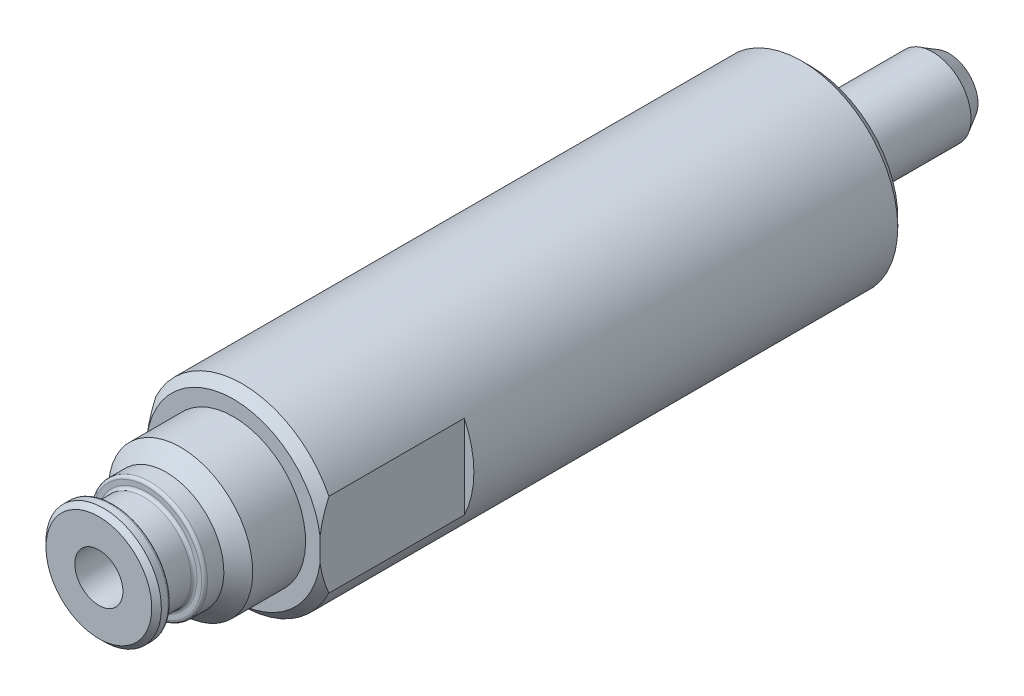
ISO-10303-21;
HEADER;
FILE_DESCRIPTION(('STEP AP214'),'2;1');
FILE_NAME('part.step','',(''),(''),'','','');
FILE_SCHEMA(('AUTOMOTIVE_DESIGN { 1 0 10303 214 1 1 1 1 }'));
ENDSEC;
DATA;
#1=APPLICATION_CONTEXT('core data for automotive mechanical design processes');
#2=APPLICATION_PROTOCOL_DEFINITION('international standard','automotive_design',2000,#1);
#3=PRODUCT_CONTEXT('',#1,'mechanical');
#4=PRODUCT('Part','Part','',(#3));
#5=PRODUCT_RELATED_PRODUCT_CATEGORY('part','',(#4));
#6=PRODUCT_DEFINITION_FORMATION('','',#4);
#7=PRODUCT_DEFINITION_CONTEXT('part definition',#1,'design');
#8=PRODUCT_DEFINITION('design','',#6,#7);
#9=PRODUCT_DEFINITION_SHAPE('','',#8);
#10=(LENGTH_UNIT() NAMED_UNIT(*) SI_UNIT(.MILLI.,.METRE.));
#11=(NAMED_UNIT(*) PLANE_ANGLE_UNIT() SI_UNIT($,.RADIAN.));
#12=(NAMED_UNIT(*) SI_UNIT($,.STERADIAN.) SOLID_ANGLE_UNIT());
#13=UNCERTAINTY_MEASURE_WITH_UNIT(LENGTH_MEASURE(1.E-05),#10,'distance_accuracy_value','');
#14=(GEOMETRIC_REPRESENTATION_CONTEXT(3) GLOBAL_UNCERTAINTY_ASSIGNED_CONTEXT((#13)) GLOBAL_UNIT_ASSIGNED_CONTEXT((#10,
#11,#12)) REPRESENTATION_CONTEXT('',''));
#15=CARTESIAN_POINT('',(0.,0.,0.));
#16=DIRECTION('',(0.,0.,1.));
#17=DIRECTION('',(1.,0.,0.));
#18=AXIS2_PLACEMENT_3D('',#15,#16,#17);
#19=CARTESIAN_POINT('',(0.,0.,-7.));
#20=DIRECTION('',(0.,0.,-1.));
#21=DIRECTION('',(-1.,0.,0.));
#22=AXIS2_PLACEMENT_3D('',#19,#20,#21);
#23=SPHERICAL_SURFACE('',#22,8.);
#24=CARTESIAN_POINT('',(0.,0.,-14.4113534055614));
#25=DIRECTION('',(0.,0.,-1.));
#26=DIRECTION('',(0.,1.,0.));
#27=AXIS2_PLACEMENT_3D('',#24,#25,#26);
#28=CIRCLE('',#27,3.01194965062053);
#29=CARTESIAN_POINT('',(0.,3.01194965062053,-14.4113534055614));
#30=VERTEX_POINT('',#29);
#31=EDGE_CURVE('E9',#30,#30,#28,.T.);
#32=ORIENTED_EDGE('',*,*,#31,.T.);
#33=EDGE_LOOP('',(#32));
#34=FACE_BOUND('',#33,.T.);
#35=ADVANCED_FACE('F14',(#34),#23,.T.);
#36=CARTESIAN_POINT('',(0.,0.,-12.7));
#37=DIRECTION('',(0.,0.,1.));
#38=DIRECTION('',(0.,-1.,0.));
#39=AXIS2_PLACEMENT_3D('',#36,#37,#38);
#40=CONICAL_SURFACE('',#39,4.,0.523598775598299);
#41=ORIENTED_EDGE('',*,*,#31,.F.);
#42=EDGE_LOOP('',(#41));
#43=FACE_BOUND('',#42,.T.);
#44=CARTESIAN_POINT('',(0.,0.,-12.7));
#45=DIRECTION('',(0.,0.,1.));
#46=DIRECTION('',(0.,-1.,0.));
#47=AXIS2_PLACEMENT_3D('',#44,#45,#46);
#48=CIRCLE('',#47,4.);
#49=CARTESIAN_POINT('',(0.,-4.,-12.7));
#50=VERTEX_POINT('',#49);
#51=EDGE_CURVE('E108',#50,#50,#48,.T.);
#52=ORIENTED_EDGE('',*,*,#51,.F.);
#53=EDGE_LOOP('',(#52));
#54=FACE_BOUND('',#53,.T.);
#55=ADVANCED_FACE('F413',(#43,#54),#40,.T.);
#56=CARTESIAN_POINT('',(0.,0.,0.));
#57=DIRECTION('',(0.,0.,-1.));
#58=DIRECTION('',(0.,1.,0.));
#59=AXIS2_PLACEMENT_3D('',#56,#57,#58);
#60=CYLINDRICAL_SURFACE('',#59,4.);
#61=CARTESIAN_POINT('',(0.,0.,0.));
#62=DIRECTION('',(0.,0.,1.));
#63=DIRECTION('',(0.,-1.,0.));
#64=AXIS2_PLACEMENT_3D('',#61,#62,#63);
#65=CIRCLE('',#64,4.);
#66=CARTESIAN_POINT('',(0.,-4.,0.));
#67=VERTEX_POINT('',#66);
#68=EDGE_CURVE('E23',#67,#67,#65,.T.);
#69=ORIENTED_EDGE('',*,*,#68,.F.);
#70=EDGE_LOOP('',(#69));
#71=FACE_BOUND('',#70,.T.);
#72=ORIENTED_EDGE('',*,*,#51,.T.);
#73=EDGE_LOOP('',(#72));
#74=FACE_BOUND('',#73,.T.);
#75=ADVANCED_FACE('F287',(#71,#74),#60,.T.);
#76=CARTESIAN_POINT('',(2.067,0.,74.));
#77=DIRECTION('',(0.,0.,-1.));
#78=DIRECTION('',(0.,1.,0.));
#79=AXIS2_PLACEMENT_3D('',#76,#77,#78);
#80=PLANE('',#79);
#81=CARTESIAN_POINT('',(0.,0.,74.));
#82=DIRECTION('',(0.,0.,1.));
#83=DIRECTION('',(1.,0.,0.));
#84=AXIS2_PLACEMENT_3D('',#81,#82,#83);
#85=CIRCLE('',#84,2.5);
#86=CARTESIAN_POINT('',(2.5,0.,74.));
#87=VERTEX_POINT('',#86);
#88=EDGE_CURVE('E439',#87,#87,#85,.T.);
#89=ORIENTED_EDGE('',*,*,#88,.F.);
#90=EDGE_LOOP('',(#89));
#91=FACE_BOUND('',#90,.T.);
#92=CARTESIAN_POINT('',(0.,0.,74.));
#93=DIRECTION('',(0.,0.,-1.));
#94=DIRECTION('',(0.,1.,0.));
#95=AXIS2_PLACEMENT_3D('',#92,#93,#94);
#96=CIRCLE('',#95,5.5);
#97=CARTESIAN_POINT('',(0.,5.5,74.));
#98=VERTEX_POINT('',#97);
#99=EDGE_CURVE('E153',#98,#98,#96,.T.);
#100=ORIENTED_EDGE('',*,*,#99,.F.);
#101=EDGE_LOOP('',(#100));
#102=FACE_BOUND('',#101,.T.);
#103=ADVANCED_FACE('F275',(#91,#102),#80,.F.);
#104=CARTESIAN_POINT('',(0.,0.,74.));
#105=DIRECTION('',(0.,0.,-1.));
#106=DIRECTION('',(0.,1.,0.));
#107=AXIS2_PLACEMENT_3D('',#104,#105,#106);
#108=CONICAL_SURFACE('',#107,5.5,0.785398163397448);
#109=CARTESIAN_POINT('',(0.,0.,73.5));
#110=DIRECTION('',(0.,0.,-1.));
#111=DIRECTION('',(0.,1.,0.));
#112=AXIS2_PLACEMENT_3D('',#109,#110,#111);
#113=CIRCLE('',#112,6.);
#114=CARTESIAN_POINT('',(0.,6.,73.5));
#115=VERTEX_POINT('',#114);
#116=EDGE_CURVE('E150',#115,#115,#113,.T.);
#117=ORIENTED_EDGE('',*,*,#116,.F.);
#118=EDGE_LOOP('',(#117));
#119=FACE_BOUND('',#118,.T.);
#120=ORIENTED_EDGE('',*,*,#99,.T.);
#121=EDGE_LOOP('',(#120));
#122=FACE_BOUND('',#121,.T.);
#123=ADVANCED_FACE('F305',(#119,#122),#108,.T.);
#124=CARTESIAN_POINT('',(0.,0.,51.5));
#125=DIRECTION('',(0.,0.,-1.));
#126=DIRECTION('',(0.,1.,0.));
#127=AXIS2_PLACEMENT_3D('',#124,#125,#126);
#128=CYLINDRICAL_SURFACE('',#127,6.);
#129=CARTESIAN_POINT('',(0.,0.,72.8));
#130=DIRECTION('',(0.,0.,-1.));
#131=DIRECTION('',(0.,1.,0.));
#132=AXIS2_PLACEMENT_3D('',#129,#130,#131);
#133=CIRCLE('',#132,6.);
#134=CARTESIAN_POINT('',(0.,6.,72.8));
#135=VERTEX_POINT('',#134);
#136=EDGE_CURVE('E147',#135,#135,#133,.T.);
#137=ORIENTED_EDGE('',*,*,#136,.F.);
#138=EDGE_LOOP('',(#137));
#139=FACE_BOUND('',#138,.T.);
#140=ORIENTED_EDGE('',*,*,#116,.T.);
#141=EDGE_LOOP('',(#140));
#142=FACE_BOUND('',#141,.T.);
#143=ADVANCED_FACE('F310',(#139,#142),#128,.T.);
#144=CARTESIAN_POINT('',(0.,0.,72.8));
#145=DIRECTION('',(0.,0.,-1.));
#146=DIRECTION('',(0.,1.,0.));
#147=AXIS2_PLACEMENT_3D('',#144,#145,#146);
#148=TOROIDAL_SURFACE('',#147,5.7,0.300000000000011);
#149=ORIENTED_EDGE('',*,*,#136,.T.);
#150=EDGE_LOOP('',(#149));
#151=FACE_BOUND('',#150,.T.);
#152=CARTESIAN_POINT('',(0.,0.,72.5));
#153=DIRECTION('',(0.,0.,-1.));
#154=DIRECTION('',(0.,1.,0.));
#155=AXIS2_PLACEMENT_3D('',#152,#153,#154);
#156=CIRCLE('',#155,5.7);
#157=CARTESIAN_POINT('',(0.,5.7,72.5));
#158=VERTEX_POINT('',#157);
#159=EDGE_CURVE('E144',#158,#158,#156,.T.);
#160=ORIENTED_EDGE('',*,*,#159,.F.);
#161=EDGE_LOOP('',(#160));
#162=FACE_BOUND('',#161,.T.);
#163=ADVANCED_FACE('F319',(#151,#162),#148,.T.);
#164=CARTESIAN_POINT('',(5.7,0.,72.5));
#165=DIRECTION('',(0.,0.,1.));
#166=DIRECTION('',(0.,-1.,0.));
#167=AXIS2_PLACEMENT_3D('',#164,#165,#166);
#168=PLANE('',#167);
#169=CARTESIAN_POINT('',(0.,0.,72.5));
#170=DIRECTION('',(0.,0.,-1.));
#171=DIRECTION('',(0.,1.,0.));
#172=AXIS2_PLACEMENT_3D('',#169,#170,#171);
#173=CIRCLE('',#172,5.2);
#174=CARTESIAN_POINT('',(0.,5.2,72.5));
#175=VERTEX_POINT('',#174);
#176=EDGE_CURVE('E141',#175,#175,#173,.T.);
#177=ORIENTED_EDGE('',*,*,#176,.F.);
#178=EDGE_LOOP('',(#177));
#179=FACE_BOUND('',#178,.T.);
#180=ORIENTED_EDGE('',*,*,#159,.T.);
#181=EDGE_LOOP('',(#180));
#182=FACE_BOUND('',#181,.T.);
#183=ADVANCED_FACE('F327',(#179,#182),#168,.F.);
#184=CARTESIAN_POINT('',(0.,0.,72.2));
#185=DIRECTION('',(0.,0.,-1.));
#186=DIRECTION('',(0.,1.,0.));
#187=AXIS2_PLACEMENT_3D('',#184,#185,#186);
#188=TOROIDAL_SURFACE('',#187,5.2,0.299999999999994);
#189=CARTESIAN_POINT('',(0.,0.,72.2));
#190=DIRECTION('',(0.,0.,-1.));
#191=DIRECTION('',(0.,1.,0.));
#192=AXIS2_PLACEMENT_3D('',#189,#190,#191);
#193=CIRCLE('',#192,4.9);
#194=CARTESIAN_POINT('',(0.,4.9,72.2));
#195=VERTEX_POINT('',#194);
#196=EDGE_CURVE('E138',#195,#195,#193,.T.);
#197=ORIENTED_EDGE('',*,*,#196,.F.);
#198=EDGE_LOOP('',(#197));
#199=FACE_BOUND('',#198,.T.);
#200=ORIENTED_EDGE('',*,*,#176,.T.);
#201=EDGE_LOOP('',(#200));
#202=FACE_BOUND('',#201,.T.);
#203=ADVANCED_FACE('F335',(#199,#202),#188,.F.);
#204=CARTESIAN_POINT('',(0.,0.,51.5));
#205=DIRECTION('',(0.,0.,-1.));
#206=DIRECTION('',(0.,1.,0.));
#207=AXIS2_PLACEMENT_3D('',#204,#205,#206);
#208=CYLINDRICAL_SURFACE('',#207,4.9);
#209=CARTESIAN_POINT('',(0.,0.,69.3));
#210=DIRECTION('',(0.,0.,-1.));
#211=DIRECTION('',(0.,1.,0.));
#212=AXIS2_PLACEMENT_3D('',#209,#210,#211);
#213=CIRCLE('',#212,4.9);
#214=CARTESIAN_POINT('',(0.,4.9,69.3));
#215=VERTEX_POINT('',#214);
#216=EDGE_CURVE('E135',#215,#215,#213,.T.);
#217=ORIENTED_EDGE('',*,*,#216,.F.);
#218=EDGE_LOOP('',(#217));
#219=FACE_BOUND('',#218,.T.);
#220=ORIENTED_EDGE('',*,*,#196,.T.);
#221=EDGE_LOOP('',(#220));
#222=FACE_BOUND('',#221,.T.);
#223=ADVANCED_FACE('F343',(#219,#222),#208,.T.);
#224=CARTESIAN_POINT('',(0.,0.,69.3));
#225=DIRECTION('',(0.,0.,-1.));
#226=DIRECTION('',(0.,1.,0.));
#227=AXIS2_PLACEMENT_3D('',#224,#225,#226);
#228=TOROIDAL_SURFACE('',#227,5.2,0.29999999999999);
#229=CARTESIAN_POINT('',(0.,0.,69.));
#230=DIRECTION('',(0.,0.,-1.));
#231=DIRECTION('',(0.,1.,0.));
#232=AXIS2_PLACEMENT_3D('',#229,#230,#231);
#233=CIRCLE('',#232,5.2);
#234=CARTESIAN_POINT('',(0.,5.2,69.));
#235=VERTEX_POINT('',#234);
#236=EDGE_CURVE('E132',#235,#235,#233,.T.);
#237=ORIENTED_EDGE('',*,*,#236,.F.);
#238=EDGE_LOOP('',(#237));
#239=FACE_BOUND('',#238,.T.);
#240=ORIENTED_EDGE('',*,*,#216,.T.);
#241=EDGE_LOOP('',(#240));
#242=FACE_BOUND('',#241,.T.);
#243=ADVANCED_FACE('F351',(#239,#242),#228,.F.);
#244=CARTESIAN_POINT('',(5.2,0.,69.));
#245=DIRECTION('',(0.,0.,-1.));
#246=DIRECTION('',(0.,1.,0.));
#247=AXIS2_PLACEMENT_3D('',#244,#245,#246);
#248=PLANE('',#247);
#249=CARTESIAN_POINT('',(0.,0.,69.));
#250=DIRECTION('',(0.,0.,-1.));
#251=DIRECTION('',(0.,1.,0.));
#252=AXIS2_PLACEMENT_3D('',#249,#250,#251);
#253=CIRCLE('',#252,5.7);
#254=CARTESIAN_POINT('',(0.,5.7,69.));
#255=VERTEX_POINT('',#254);
#256=EDGE_CURVE('E129',#255,#255,#253,.T.);
#257=ORIENTED_EDGE('',*,*,#256,.F.);
#258=EDGE_LOOP('',(#257));
#259=FACE_BOUND('',#258,.T.);
#260=ORIENTED_EDGE('',*,*,#236,.T.);
#261=EDGE_LOOP('',(#260));
#262=FACE_BOUND('',#261,.T.);
#263=ADVANCED_FACE('F359',(#259,#262),#248,.F.);
#264=CARTESIAN_POINT('',(0.,0.,68.7));
#265=DIRECTION('',(0.,0.,-1.));
#266=DIRECTION('',(0.,1.,0.));
#267=AXIS2_PLACEMENT_3D('',#264,#265,#266);
#268=TOROIDAL_SURFACE('',#267,5.7,0.300000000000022);
#269=ORIENTED_EDGE('',*,*,#256,.T.);
#270=EDGE_LOOP('',(#269));
#271=FACE_BOUND('',#270,.T.);
#272=CARTESIAN_POINT('',(0.,0.,68.7));
#273=DIRECTION('',(0.,0.,-1.));
#274=DIRECTION('',(0.,1.,0.));
#275=AXIS2_PLACEMENT_3D('',#272,#273,#274);
#276=CIRCLE('',#275,6.);
#277=CARTESIAN_POINT('',(0.,6.,68.7));
#278=VERTEX_POINT('',#277);
#279=EDGE_CURVE('E126',#278,#278,#276,.T.);
#280=ORIENTED_EDGE('',*,*,#279,.F.);
#281=EDGE_LOOP('',(#280));
#282=FACE_BOUND('',#281,.T.);
#283=ADVANCED_FACE('F367',(#271,#282),#268,.T.);
#284=CARTESIAN_POINT('',(0.,0.,51.5));
#285=DIRECTION('',(0.,0.,-1.));
#286=DIRECTION('',(0.,1.,0.));
#287=AXIS2_PLACEMENT_3D('',#284,#285,#286);
#288=CYLINDRICAL_SURFACE('',#287,6.);
#289=CARTESIAN_POINT('',(0.,0.,67.));
#290=DIRECTION('',(0.,0.,-1.));
#291=DIRECTION('',(0.,1.,0.));
#292=AXIS2_PLACEMENT_3D('',#289,#290,#291);
#293=CIRCLE('',#292,6.);
#294=CARTESIAN_POINT('',(0.,6.,67.));
#295=VERTEX_POINT('',#294);
#296=EDGE_CURVE('E122',#295,#295,#293,.T.);
#297=ORIENTED_EDGE('',*,*,#296,.F.);
#298=EDGE_LOOP('',(#297));
#299=FACE_BOUND('',#298,.T.);
#300=ORIENTED_EDGE('',*,*,#279,.T.);
#301=EDGE_LOOP('',(#300));
#302=FACE_BOUND('',#301,.T.);
#303=ADVANCED_FACE('F375',(#299,#302),#288,.T.);
#304=CARTESIAN_POINT('',(0.,0.,67.));
#305=DIRECTION('',(0.,0.,-1.));
#306=DIRECTION('',(0.,1.,0.));
#307=AXIS2_PLACEMENT_3D('',#304,#305,#306);
#308=CONICAL_SURFACE('',#307,6.,0.785398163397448);
#309=CARTESIAN_POINT('',(0.,0.,65.5));
#310=DIRECTION('',(0.,0.,-1.));
#311=DIRECTION('',(0.,1.,0.));
#312=AXIS2_PLACEMENT_3D('',#309,#310,#311);
#313=CIRCLE('',#312,7.5);
#314=CARTESIAN_POINT('',(0.,7.5,65.5));
#315=VERTEX_POINT('',#314);
#316=EDGE_CURVE('E119',#315,#315,#313,.T.);
#317=ORIENTED_EDGE('',*,*,#316,.F.);
#318=EDGE_LOOP('',(#317));
#319=FACE_BOUND('',#318,.T.);
#320=ORIENTED_EDGE('',*,*,#296,.T.);
#321=EDGE_LOOP('',(#320));
#322=FACE_BOUND('',#321,.T.);
#323=ADVANCED_FACE('F191',(#319,#322),#308,.T.);
#324=CARTESIAN_POINT('',(0.,0.,51.5));
#325=DIRECTION('',(0.,0.,-1.));
#326=DIRECTION('',(0.,1.,0.));
#327=AXIS2_PLACEMENT_3D('',#324,#325,#326);
#328=CYLINDRICAL_SURFACE('',#327,7.5);
#329=CARTESIAN_POINT('',(0.,0.,60.));
#330=DIRECTION('',(0.,0.,-1.));
#331=DIRECTION('',(0.,1.,0.));
#332=AXIS2_PLACEMENT_3D('',#329,#330,#331);
#333=CIRCLE('',#332,7.5);
#334=CARTESIAN_POINT('',(0.,7.5,60.));
#335=VERTEX_POINT('',#334);
#336=EDGE_CURVE('E95',#335,#335,#333,.T.);
#337=ORIENTED_EDGE('',*,*,#336,.F.);
#338=EDGE_LOOP('',(#337));
#339=FACE_BOUND('',#338,.T.);
#340=ORIENTED_EDGE('',*,*,#316,.T.);
#341=EDGE_LOOP('',(#340));
#342=FACE_BOUND('',#341,.T.);
#343=ADVANCED_FACE('F181',(#339,#342),#328,.T.);
#344=CARTESIAN_POINT('',(9.08,0.,60.));
#345=DIRECTION('',(0.,0.,1.));
#346=DIRECTION('',(0.,-1.,0.));
#347=AXIS2_PLACEMENT_3D('',#344,#345,#346);
#348=PLANE('',#347);
#349=ORIENTED_EDGE('',*,*,#336,.T.);
#350=EDGE_LOOP('',(#349));
#351=FACE_BOUND('',#350,.T.);
#352=CARTESIAN_POINT('',(0.,0.,60.));
#353=DIRECTION('',(0.,0.,-1.));
#354=DIRECTION('',(0.,1.,0.));
#355=AXIS2_PLACEMENT_3D('',#352,#353,#354);
#356=CIRCLE('',#355,9.08);
#357=CARTESIAN_POINT('',(-9.,1.20266371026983,60.));
#358=VERTEX_POINT('',#357);
#359=CARTESIAN_POINT('',(9.,1.20266371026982,60.));
#360=VERTEX_POINT('',#359);
#361=EDGE_CURVE('E92',#358,#360,#356,.T.);
#362=ORIENTED_EDGE('',*,*,#361,.F.);
#363=DIRECTION('',(0.,-1.,0.));
#364=VECTOR('',#363,1.);
#365=CARTESIAN_POINT('',(-9.,0.,60.));
#366=LINE('',#365,#364);
#367=CARTESIAN_POINT('',(-9.,-1.20266371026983,60.));
#368=VERTEX_POINT('',#367);
#369=EDGE_CURVE('E78',#358,#368,#366,.T.);
#370=ORIENTED_EDGE('',*,*,#369,.T.);
#371=CARTESIAN_POINT('',(9.,-1.20266371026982,60.));
#372=VERTEX_POINT('',#371);
#373=EDGE_CURVE('E85',#372,#368,#356,.T.);
#374=ORIENTED_EDGE('',*,*,#373,.F.);
#375=DIRECTION('',(0.,1.,0.));
#376=VECTOR('',#375,1.);
#377=CARTESIAN_POINT('',(9.,0.,60.));
#378=LINE('',#377,#376);
#379=EDGE_CURVE('E68',#372,#360,#378,.T.);
#380=ORIENTED_EDGE('',*,*,#379,.T.);
#381=EDGE_LOOP('',(#362,#370,#374,#380));
#382=FACE_BOUND('',#381,.T.);
#383=ADVANCED_FACE('F90',(#351,#382),#348,.T.);
#384=CARTESIAN_POINT('',(0.,0.,59.08));
#385=DIRECTION('',(0.,0.,-1.));
#386=DIRECTION('',(0.,1.,0.));
#387=AXIS2_PLACEMENT_3D('',#384,#385,#386);
#388=CONICAL_SURFACE('',#387,10.,0.78539816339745);
#389=CARTESIAN_POINT('',(0.,0.,59.08));
#390=DIRECTION('',(0.,0.,-1.));
#391=DIRECTION('',(0.,1.,0.));
#392=AXIS2_PLACEMENT_3D('',#389,#390,#391);
#393=CIRCLE('',#392,10.);
#394=CARTESIAN_POINT('',(-9.,4.35889894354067,59.08));
#395=VERTEX_POINT('',#394);
#396=CARTESIAN_POINT('',(9.,4.35889894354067,59.08));
#397=VERTEX_POINT('',#396);
#398=EDGE_CURVE('E91',#395,#397,#393,.T.);
#399=ORIENTED_EDGE('',*,*,#398,.F.);
#400=CARTESIAN_POINT('',(-9.,20.0889844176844,47.0671107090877));
#401=CARTESIAN_POINT('',(-9.,19.7941845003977,47.3361376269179));
#402=CARTESIAN_POINT('',(-9.,19.4988987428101,47.6046332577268));
#403=CARTESIAN_POINT('',(-9.,18.9072134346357,48.1403994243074));
#404=CARTESIAN_POINT('',(-9.,18.6108138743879,48.4076699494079));
#405=CARTESIAN_POINT('',(-9.,18.0166892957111,48.9408857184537));
#406=CARTESIAN_POINT('',(-9.,17.7189639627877,49.2068306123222));
#407=CARTESIAN_POINT('',(-9.,17.1220890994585,49.7371142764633));
#408=CARTESIAN_POINT('',(-9.,16.822939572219,50.0014530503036));
#409=CARTESIAN_POINT('',(-9.,15.9186985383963,50.7955547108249));
#410=CARTESIAN_POINT('',(-9.,15.3111326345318,51.3225158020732));
#411=CARTESIAN_POINT('',(-9.,14.3932925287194,52.1052669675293));
#412=CARTESIAN_POINT('',(-9.,14.0862824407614,52.3648870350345));
#413=CARTESIAN_POINT('',(-9.,13.4697157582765,52.8810880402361));
#414=CARTESIAN_POINT('',(-9.,13.1601591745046,53.137668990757));
#415=CARTESIAN_POINT('',(-9.,12.5849192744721,53.6088254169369));
#416=CARTESIAN_POINT('',(-9.,12.3196505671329,53.8239068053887));
#417=CARTESIAN_POINT('',(-9.,11.7866455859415,54.2509886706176));
#418=CARTESIAN_POINT('',(-9.,11.5189093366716,54.4629891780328));
#419=CARTESIAN_POINT('',(-9.,10.9804995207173,54.883413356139));
#420=CARTESIAN_POINT('',(-9.,10.7098250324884,55.0918358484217));
#421=CARTESIAN_POINT('',(-9.,10.1651714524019,55.5043204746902));
#422=CARTESIAN_POINT('',(-9.,9.89119239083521,55.7083826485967));
#423=CARTESIAN_POINT('',(-9.,9.33978293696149,56.1109565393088));
#424=CARTESIAN_POINT('',(-9.,9.06235809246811,56.3094758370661));
#425=CARTESIAN_POINT('',(-9.,8.50301529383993,56.7001296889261));
#426=CARTESIAN_POINT('',(-9.,8.22109712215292,56.8922639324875));
#427=CARTESIAN_POINT('',(-9.,7.65217834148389,57.2685512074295));
#428=CARTESIAN_POINT('',(-9.,7.36518050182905,57.4527084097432));
#429=CARTESIAN_POINT('',(-9.,6.78513344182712,57.8111918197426));
#430=CARTESIAN_POINT('',(-9.,6.49208508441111,57.9855194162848));
#431=CARTESIAN_POINT('',(-9.,5.90679788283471,58.317393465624));
#432=CARTESIAN_POINT('',(-9.,5.61474269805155,58.4752618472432));
#433=CARTESIAN_POINT('',(-9.,5.02305416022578,58.7763015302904));
#434=CARTESIAN_POINT('',(-9.,4.72342010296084,58.9194714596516));
#435=CARTESIAN_POINT('',(-9.,4.11636189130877,59.1870563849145));
#436=CARTESIAN_POINT('',(-9.,3.80895049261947,59.3115000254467));
#437=CARTESIAN_POINT('',(-9.,3.18569208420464,59.5372331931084));
#438=CARTESIAN_POINT('',(-9.,2.86984745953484,59.6385291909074));
#439=CARTESIAN_POINT('',(-9.,2.29142781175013,59.7962123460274));
#440=CARTESIAN_POINT('',(-9.,2.03019136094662,59.8574808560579));
#441=CARTESIAN_POINT('',(-9.,1.5036267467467,59.958913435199));
#442=CARTESIAN_POINT('',(-9.,1.23829917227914,59.9990805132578));
#443=CARTESIAN_POINT('',(-9.,0.705706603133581,60.0562472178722));
#444=CARTESIAN_POINT('',(-9.,0.438447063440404,60.0732969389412));
#445=CARTESIAN_POINT('',(-9.,-0.0965355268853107,60.0834560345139));
#446=CARTESIAN_POINT('',(-9.,-0.364258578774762,60.076565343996));
#447=CARTESIAN_POINT('',(-9.,-0.89754729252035,60.0392623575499));
#448=CARTESIAN_POINT('',(-9.,-1.1631159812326,60.0088926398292));
#449=CARTESIAN_POINT('',(-9.,-1.69079838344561,59.9262664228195));
#450=CARTESIAN_POINT('',(-9.,-1.95291180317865,59.8740080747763));
#451=CARTESIAN_POINT('',(-9.,-2.47314253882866,59.7498122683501));
#452=CARTESIAN_POINT('',(-9.,-2.73124679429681,59.6778207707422));
#453=CARTESIAN_POINT('',(-9.,-3.24205693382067,59.516938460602));
#454=CARTESIAN_POINT('',(-9.,-3.49476303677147,59.4280483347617));
#455=CARTESIAN_POINT('',(-9.,-4.07604409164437,59.2047542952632));
#456=CARTESIAN_POINT('',(-9.,-4.40253716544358,59.0649539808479));
#457=CARTESIAN_POINT('',(-9.,-5.0464515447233,58.7656734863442));
#458=CARTESIAN_POINT('',(-9.,-5.36386785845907,58.6061827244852));
#459=CARTESIAN_POINT('',(-9.,-5.99110227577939,58.2715395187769));
#460=CARTESIAN_POINT('',(-9.,-6.30090358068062,58.0963558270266));
#461=CARTESIAN_POINT('',(-9.,-6.91327229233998,57.7339678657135));
#462=CARTESIAN_POINT('',(-9.,-7.21584094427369,57.5467656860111));
#463=CARTESIAN_POINT('',(-9.,-7.81811190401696,57.160734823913));
#464=CARTESIAN_POINT('',(-9.,-8.11774682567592,56.9618014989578));
#465=CARTESIAN_POINT('',(-9.,-8.71169811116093,56.5561568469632));
#466=CARTESIAN_POINT('',(-9.,-9.00601430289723,56.3494452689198));
#467=CARTESIAN_POINT('',(-9.,-9.58977868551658,55.9299922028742));
#468=CARTESIAN_POINT('',(-9.,-9.87923221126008,55.717258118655));
#469=CARTESIAN_POINT('',(-9.,-10.4543036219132,55.2866619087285));
#470=CARTESIAN_POINT('',(-9.,-10.7399213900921,55.0687996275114));
#471=CARTESIAN_POINT('',(-9.,-11.4242974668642,54.5386678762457));
#472=CARTESIAN_POINT('',(-9.,-11.8214368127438,54.2243100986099));
#473=CARTESIAN_POINT('',(-9.,-12.6104586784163,53.5890670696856));
#474=CARTESIAN_POINT('',(-9.,-13.0023410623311,53.2681816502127));
#475=CARTESIAN_POINT('',(-9.,-13.7819938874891,52.6210793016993));
#476=CARTESIAN_POINT('',(-9.,-14.1697622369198,52.2948598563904));
#477=CARTESIAN_POINT('',(-9.,-14.9417496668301,51.6382482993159));
#478=CARTESIAN_POINT('',(-9.,-15.3259687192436,51.3078561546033));
#479=CARTESIAN_POINT('',(-9.,-16.0783900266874,50.6549933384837));
#480=CARTESIAN_POINT('',(-9.,-16.44669153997,50.3326369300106));
#481=CARTESIAN_POINT('',(-9.,-17.1809601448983,49.6852740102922));
#482=CARTESIAN_POINT('',(-9.,-17.5469272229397,49.3602674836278));
#483=CARTESIAN_POINT('',(-9.,-18.276556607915,48.7083120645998));
#484=CARTESIAN_POINT('',(-9.,-18.640220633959,48.3813650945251));
#485=CARTESIAN_POINT('',(-9.,-19.3658255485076,47.725578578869));
#486=CARTESIAN_POINT('',(-9.,-19.727766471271,47.3967390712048));
#487=CARTESIAN_POINT('',(-9.,-20.0889844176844,47.0671107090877));
#488=B_SPLINE_CURVE_WITH_KNOTS('',3,(#400,#401,#402,#403,#404,#405,#406,#407,#408,#409,#410,
#411,#412,#413,#414,#415,#416,#417,#418,#419,#420,#421,#422,#423,#424,#425,#426,#427,#428,#429,
#430,#431,#432,#433,#434,#435,#436,#437,#438,#439,#440,#441,#442,#443,#444,#445,#446,#447,#448,
#449,#450,#451,#452,#453,#454,#455,#456,#457,#458,#459,#460,#461,#462,#463,#464,#465,#466,#467,
#468,#469,#470,#471,#472,#473,#474,#475,#476,#477,#478,#479,#480,#481,#482,#483,#484,#485,#486,
#487),.UNSPECIFIED.,.F.,.F.,(4,2,2,2,2,2,2,2,2,2,2,2,2,2,2,2,2,2,2,2,2,2,2,2,2,2,2,2,2,2,2,2,2,
2,2,2,2,2,2,2,2,2,2,4),(0.,1.19730659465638,2.39462359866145,3.59224161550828,4.78985697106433,
7.20251667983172,8.40870278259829,9.61488379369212,10.639387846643,11.663881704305,
12.6887067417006,13.7135223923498,14.7368599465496,15.7602471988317,16.7830927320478,
17.8057933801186,18.8014398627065,19.7971792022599,20.7913795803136,21.7853016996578,
22.5895213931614,23.3936263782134,24.1959860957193,24.9983479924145,25.7992582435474,
26.6002361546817,27.4034298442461,28.206590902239,29.2712072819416,30.3363983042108,
31.4037596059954,32.47093580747,33.5497661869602,34.6286314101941,35.70622346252,
36.7838482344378,38.303247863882,39.8226866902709,41.3428642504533,42.8630538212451,
44.3313839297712,45.7997225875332,47.2667917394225,48.7338316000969),.UNSPECIFIED.);
#489=EDGE_CURVE('E197',#395,#358,#488,.T.);
#490=ORIENTED_EDGE('',*,*,#489,.T.);
#491=ORIENTED_EDGE('',*,*,#361,.T.);
#492=CARTESIAN_POINT('',(9.,-20.0889844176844,47.0671107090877));
#493=CARTESIAN_POINT('',(9.,-19.7941845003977,47.3361376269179));
#494=CARTESIAN_POINT('',(9.,-19.4988987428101,47.6046332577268));
#495=CARTESIAN_POINT('',(9.,-18.9072134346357,48.1403994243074));
#496=CARTESIAN_POINT('',(9.,-18.6108138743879,48.4076699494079));
#497=CARTESIAN_POINT('',(9.,-18.0166892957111,48.9408857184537));
#498=CARTESIAN_POINT('',(9.,-17.7189639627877,49.2068306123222));
#499=CARTESIAN_POINT('',(9.,-17.1220890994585,49.7371142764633));
#500=CARTESIAN_POINT('',(9.,-16.822939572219,50.0014530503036));
#501=CARTESIAN_POINT('',(9.,-15.9186985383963,50.7955547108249));
#502=CARTESIAN_POINT('',(9.,-15.3111326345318,51.3225158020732));
#503=CARTESIAN_POINT('',(9.,-14.3932925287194,52.1052669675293));
#504=CARTESIAN_POINT('',(9.,-14.0862824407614,52.3648870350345));
#505=CARTESIAN_POINT('',(9.,-13.4697157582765,52.8810880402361));
#506=CARTESIAN_POINT('',(9.,-13.1601591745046,53.137668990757));
#507=CARTESIAN_POINT('',(9.,-12.5849192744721,53.6088254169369));
#508=CARTESIAN_POINT('',(9.,-12.3196505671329,53.8239068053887));
#509=CARTESIAN_POINT('',(9.,-11.7866455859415,54.2509886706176));
#510=CARTESIAN_POINT('',(9.,-11.5189093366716,54.4629891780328));
#511=CARTESIAN_POINT('',(9.,-10.9804995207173,54.883413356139));
#512=CARTESIAN_POINT('',(9.,-10.7098250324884,55.0918358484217));
#513=CARTESIAN_POINT('',(9.,-10.1651714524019,55.5043204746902));
#514=CARTESIAN_POINT('',(9.,-9.89119239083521,55.7083826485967));
#515=CARTESIAN_POINT('',(9.,-9.33978293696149,56.1109565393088));
#516=CARTESIAN_POINT('',(9.,-9.06235809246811,56.3094758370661));
#517=CARTESIAN_POINT('',(9.,-8.50301529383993,56.7001296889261));
#518=CARTESIAN_POINT('',(9.,-8.22109712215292,56.8922639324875));
#519=CARTESIAN_POINT('',(9.,-7.65217834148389,57.2685512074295));
#520=CARTESIAN_POINT('',(9.,-7.36518050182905,57.4527084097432));
#521=CARTESIAN_POINT('',(9.,-6.78513344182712,57.8111918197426));
#522=CARTESIAN_POINT('',(9.,-6.49208508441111,57.9855194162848));
#523=CARTESIAN_POINT('',(9.,-5.90679788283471,58.317393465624));
#524=CARTESIAN_POINT('',(9.,-5.61474269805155,58.4752618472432));
#525=CARTESIAN_POINT('',(9.,-5.02305416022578,58.7763015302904));
#526=CARTESIAN_POINT('',(9.,-4.72342010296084,58.9194714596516));
#527=CARTESIAN_POINT('',(9.,-4.11636189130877,59.1870563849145));
#528=CARTESIAN_POINT('',(9.,-3.80895049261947,59.3115000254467));
#529=CARTESIAN_POINT('',(9.,-3.18569208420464,59.5372331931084));
#530=CARTESIAN_POINT('',(9.,-2.86984745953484,59.6385291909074));
#531=CARTESIAN_POINT('',(9.,-2.29142781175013,59.7962123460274));
#532=CARTESIAN_POINT('',(9.,-2.03019136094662,59.8574808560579));
#533=CARTESIAN_POINT('',(9.,-1.5036267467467,59.958913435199));
#534=CARTESIAN_POINT('',(9.,-1.23829917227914,59.9990805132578));
#535=CARTESIAN_POINT('',(9.,-0.705706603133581,60.0562472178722));
#536=CARTESIAN_POINT('',(9.,-0.438447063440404,60.0732969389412));
#537=CARTESIAN_POINT('',(9.,0.0965355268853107,60.0834560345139));
#538=CARTESIAN_POINT('',(9.,0.364258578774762,60.076565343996));
#539=CARTESIAN_POINT('',(9.,0.89754729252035,60.0392623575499));
#540=CARTESIAN_POINT('',(9.,1.1631159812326,60.0088926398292));
#541=CARTESIAN_POINT('',(9.,1.69079838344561,59.9262664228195));
#542=CARTESIAN_POINT('',(9.,1.95291180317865,59.8740080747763));
#543=CARTESIAN_POINT('',(9.,2.47314253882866,59.7498122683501));
#544=CARTESIAN_POINT('',(9.,2.73124679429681,59.6778207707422));
#545=CARTESIAN_POINT('',(9.,3.24205693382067,59.516938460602));
#546=CARTESIAN_POINT('',(9.,3.49476303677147,59.4280483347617));
#547=CARTESIAN_POINT('',(9.,4.07604409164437,59.2047542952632));
#548=CARTESIAN_POINT('',(9.,4.40253716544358,59.0649539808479));
#549=CARTESIAN_POINT('',(9.,5.0464515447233,58.7656734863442));
#550=CARTESIAN_POINT('',(9.,5.36386785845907,58.6061827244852));
#551=CARTESIAN_POINT('',(9.,5.99110227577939,58.2715395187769));
#552=CARTESIAN_POINT('',(9.,6.30090358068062,58.0963558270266));
#553=CARTESIAN_POINT('',(9.,6.91327229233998,57.7339678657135));
#554=CARTESIAN_POINT('',(9.,7.21584094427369,57.5467656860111));
#555=CARTESIAN_POINT('',(9.,7.81811190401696,57.160734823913));
#556=CARTESIAN_POINT('',(9.,8.11774682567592,56.9618014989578));
#557=CARTESIAN_POINT('',(9.,8.71169811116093,56.5561568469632));
#558=CARTESIAN_POINT('',(9.,9.00601430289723,56.3494452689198));
#559=CARTESIAN_POINT('',(9.,9.58977868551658,55.9299922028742));
#560=CARTESIAN_POINT('',(9.,9.87923221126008,55.717258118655));
#561=CARTESIAN_POINT('',(9.,10.4543036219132,55.2866619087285));
#562=CARTESIAN_POINT('',(9.,10.7399213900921,55.0687996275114));
#563=CARTESIAN_POINT('',(9.,11.4242974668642,54.5386678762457));
#564=CARTESIAN_POINT('',(9.,11.8214368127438,54.2243100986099));
#565=CARTESIAN_POINT('',(9.,12.6104586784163,53.5890670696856));
#566=CARTESIAN_POINT('',(9.,13.0023410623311,53.2681816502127));
#567=CARTESIAN_POINT('',(9.,13.7819938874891,52.6210793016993));
#568=CARTESIAN_POINT('',(9.,14.1697622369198,52.2948598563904));
#569=CARTESIAN_POINT('',(9.,14.9417496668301,51.6382482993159));
#570=CARTESIAN_POINT('',(9.,15.3259687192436,51.3078561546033));
#571=CARTESIAN_POINT('',(9.,16.0783900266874,50.6549933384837));
#572=CARTESIAN_POINT('',(9.,16.44669153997,50.3326369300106));
#573=CARTESIAN_POINT('',(9.,17.1809601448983,49.6852740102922));
#574=CARTESIAN_POINT('',(9.,17.5469272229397,49.3602674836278));
#575=CARTESIAN_POINT('',(9.,18.276556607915,48.7083120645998));
#576=CARTESIAN_POINT('',(9.,18.640220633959,48.3813650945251));
#577=CARTESIAN_POINT('',(9.,19.3658255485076,47.725578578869));
#578=CARTESIAN_POINT('',(9.,19.727766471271,47.3967390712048));
#579=CARTESIAN_POINT('',(9.,20.0889844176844,47.0671107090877));
#580=B_SPLINE_CURVE_WITH_KNOTS('',3,(#492,#493,#494,#495,#496,#497,#498,#499,#500,#501,#502,
#503,#504,#505,#506,#507,#508,#509,#510,#511,#512,#513,#514,#515,#516,#517,#518,#519,#520,#521,
#522,#523,#524,#525,#526,#527,#528,#529,#530,#531,#532,#533,#534,#535,#536,#537,#538,#539,#540,
#541,#542,#543,#544,#545,#546,#547,#548,#549,#550,#551,#552,#553,#554,#555,#556,#557,#558,#559,
#560,#561,#562,#563,#564,#565,#566,#567,#568,#569,#570,#571,#572,#573,#574,#575,#576,#577,#578,
#579),.UNSPECIFIED.,.F.,.F.,(4,2,2,2,2,2,2,2,2,2,2,2,2,2,2,2,2,2,2,2,2,2,2,2,2,2,2,2,2,2,2,2,2,
2,2,2,2,2,2,2,2,2,2,4),(0.,1.19730659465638,2.39462359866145,3.59224161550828,4.78985697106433,
7.20251667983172,8.40870278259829,9.61488379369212,10.639387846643,11.663881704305,
12.6887067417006,13.7135223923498,14.7368599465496,15.7602471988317,16.7830927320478,
17.8057933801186,18.8014398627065,19.7971792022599,20.7913795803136,21.7853016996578,
22.5895213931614,23.3936263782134,24.1959860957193,24.9983479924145,25.7992582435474,
26.6002361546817,27.4034298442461,28.206590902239,29.2712072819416,30.3363983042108,
31.4037596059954,32.47093580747,33.5497661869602,34.6286314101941,35.70622346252,
36.7838482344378,38.303247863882,39.8226866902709,41.3428642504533,42.8630538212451,
44.3313839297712,45.7997225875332,47.2667917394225,48.7338316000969),.UNSPECIFIED.);
#581=EDGE_CURVE('E31',#360,#397,#580,.T.);
#582=ORIENTED_EDGE('',*,*,#581,.T.);
#583=EDGE_LOOP('',(#399,#490,#491,#582));
#584=FACE_BOUND('',#583,.T.);
#585=ADVANCED_FACE('F168',(#584),#388,.T.);
#586=CARTESIAN_POINT('',(0.,0.,45.));
#587=DIRECTION('',(0.,0.,1.));
#588=DIRECTION('',(0.,-1.,0.));
#589=AXIS2_PLACEMENT_3D('',#586,#587,#588);
#590=PLANE('',#589);
#591=DIRECTION('',(0.,-1.,0.));
#592=VECTOR('',#591,1.);
#593=CARTESIAN_POINT('',(-9.,10.,45.));
#594=LINE('',#593,#592);
#595=CARTESIAN_POINT('',(-9.,4.35889894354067,45.));
#596=VERTEX_POINT('',#595);
#597=CARTESIAN_POINT('',(-9.,-4.35889894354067,45.));
#598=VERTEX_POINT('',#597);
#599=EDGE_CURVE('E158',#596,#598,#594,.T.);
#600=ORIENTED_EDGE('',*,*,#599,.F.);
#601=CARTESIAN_POINT('',(0.,0.,45.));
#602=DIRECTION('',(0.,0.,1.));
#603=DIRECTION('',(0.,-1.,0.));
#604=AXIS2_PLACEMENT_3D('',#601,#602,#603);
#605=CIRCLE('',#604,10.);
#606=EDGE_CURVE('E104',#598,#596,#605,.F.);
#607=ORIENTED_EDGE('',*,*,#606,.F.);
#608=EDGE_LOOP('',(#600,#607));
#609=FACE_BOUND('',#608,.T.);
#610=ADVANCED_FACE('F189',(#609),#590,.T.);
#611=CARTESIAN_POINT('',(-9.,10.,45.));
#612=DIRECTION('',(-1.,0.,0.));
#613=DIRECTION('',(0.,-1.,0.));
#614=AXIS2_PLACEMENT_3D('',#611,#612,#613);
#615=PLANE('',#614);
#616=ORIENTED_EDGE('',*,*,#599,.T.);
#617=DIRECTION('',(0.,0.,-1.));
#618=VECTOR('',#617,1.);
#619=CARTESIAN_POINT('',(-9.,-4.35889894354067,0.));
#620=LINE('',#619,#618);
#621=CARTESIAN_POINT('',(-9.,-4.35889894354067,59.08));
#622=VERTEX_POINT('',#621);
#623=EDGE_CURVE('E200',#622,#598,#620,.T.);
#624=ORIENTED_EDGE('',*,*,#623,.F.);
#625=EDGE_CURVE('E39',#368,#622,#488,.T.);
#626=ORIENTED_EDGE('',*,*,#625,.F.);
#627=ORIENTED_EDGE('',*,*,#369,.F.);
#628=ORIENTED_EDGE('',*,*,#489,.F.);
#629=DIRECTION('',(0.,0.,-1.));
#630=VECTOR('',#629,1.);
#631=CARTESIAN_POINT('',(-9.,4.35889894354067,0.));
#632=LINE('',#631,#630);
#633=EDGE_CURVE('E196',#596,#395,#632,.F.);
#634=ORIENTED_EDGE('',*,*,#633,.F.);
#635=EDGE_LOOP('',(#616,#624,#626,#627,#628,#634));
#636=FACE_BOUND('',#635,.T.);
#637=ADVANCED_FACE('F177',(#636),#615,.T.);
#638=ORIENTED_EDGE('',*,*,#373,.T.);
#639=ORIENTED_EDGE('',*,*,#625,.T.);
#640=CARTESIAN_POINT('',(9.,-4.35889894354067,59.08));
#641=VERTEX_POINT('',#640);
#642=EDGE_CURVE('E86',#641,#622,#393,.T.);
#643=ORIENTED_EDGE('',*,*,#642,.F.);
#644=EDGE_CURVE('E72',#641,#372,#580,.T.);
#645=ORIENTED_EDGE('',*,*,#644,.T.);
#646=EDGE_LOOP('',(#638,#639,#643,#645));
#647=FACE_BOUND('',#646,.T.);
#648=ADVANCED_FACE('F84',(#647),#388,.T.);
#649=DIRECTION('',(0.,1.,0.));
#650=VECTOR('',#649,1.);
#651=CARTESIAN_POINT('',(9.,-10.,45.));
#652=LINE('',#651,#650);
#653=CARTESIAN_POINT('',(9.,-4.35889894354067,45.));
#654=VERTEX_POINT('',#653);
#655=CARTESIAN_POINT('',(9.,4.35889894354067,45.));
#656=VERTEX_POINT('',#655);
#657=EDGE_CURVE('E156',#654,#656,#652,.T.);
#658=ORIENTED_EDGE('',*,*,#657,.F.);
#659=EDGE_CURVE('E18',#656,#654,#605,.F.);
#660=ORIENTED_EDGE('',*,*,#659,.F.);
#661=EDGE_LOOP('',(#658,#660));
#662=FACE_BOUND('',#661,.T.);
#663=ADVANCED_FACE('F176',(#662),#590,.T.);
#664=CARTESIAN_POINT('',(9.,-10.,45.));
#665=DIRECTION('',(1.,0.,0.));
#666=DIRECTION('',(0.,1.,0.));
#667=AXIS2_PLACEMENT_3D('',#664,#665,#666);
#668=PLANE('',#667);
#669=ORIENTED_EDGE('',*,*,#657,.T.);
#670=DIRECTION('',(0.,0.,-1.));
#671=VECTOR('',#670,1.);
#672=CARTESIAN_POINT('',(9.,4.35889894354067,0.));
#673=LINE('',#672,#671);
#674=EDGE_CURVE('E88',#397,#656,#673,.T.);
#675=ORIENTED_EDGE('',*,*,#674,.F.);
#676=ORIENTED_EDGE('',*,*,#581,.F.);
#677=ORIENTED_EDGE('',*,*,#379,.F.);
#678=ORIENTED_EDGE('',*,*,#644,.F.);
#679=DIRECTION('',(0.,0.,-1.));
#680=VECTOR('',#679,1.);
#681=CARTESIAN_POINT('',(9.,-4.35889894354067,0.));
#682=LINE('',#681,#680);
#683=EDGE_CURVE('E87',#654,#641,#682,.F.);
#684=ORIENTED_EDGE('',*,*,#683,.F.);
#685=EDGE_LOOP('',(#669,#675,#676,#677,#678,#684));
#686=FACE_BOUND('',#685,.T.);
#687=ADVANCED_FACE('F71',(#686),#668,.T.);
#688=CARTESIAN_POINT('',(0.,0.,0.));
#689=DIRECTION('',(0.,0.,-1.));
#690=DIRECTION('',(0.,1.,0.));
#691=AXIS2_PLACEMENT_3D('',#688,#689,#690);
#692=CYLINDRICAL_SURFACE('',#691,10.);
#693=CARTESIAN_POINT('',(0.,0.,0.92));
#694=DIRECTION('',(0.,0.,-1.));
#695=DIRECTION('',(0.,1.,0.));
#696=AXIS2_PLACEMENT_3D('',#693,#694,#695);
#697=CIRCLE('',#696,10.);
#698=CARTESIAN_POINT('',(0.,10.,0.92));
#699=VERTEX_POINT('',#698);
#700=EDGE_CURVE('E99',#699,#699,#697,.T.);
#701=ORIENTED_EDGE('',*,*,#700,.F.);
#702=EDGE_LOOP('',(#701));
#703=FACE_BOUND('',#702,.T.);
#704=ORIENTED_EDGE('',*,*,#674,.T.);
#705=ORIENTED_EDGE('',*,*,#659,.T.);
#706=ORIENTED_EDGE('',*,*,#683,.T.);
#707=ORIENTED_EDGE('',*,*,#642,.T.);
#708=ORIENTED_EDGE('',*,*,#623,.T.);
#709=ORIENTED_EDGE('',*,*,#606,.T.);
#710=ORIENTED_EDGE('',*,*,#633,.T.);
#711=ORIENTED_EDGE('',*,*,#398,.T.);
#712=EDGE_LOOP('',(#704,#705,#706,#707,#708,#709,#710,#711));
#713=FACE_BOUND('',#712,.T.);
#714=ADVANCED_FACE('F175',(#703,#713),#692,.T.);
#715=CARTESIAN_POINT('',(0.,0.,0.));
#716=DIRECTION('',(0.,0.,1.));
#717=DIRECTION('',(0.,-1.,0.));
#718=AXIS2_PLACEMENT_3D('',#715,#716,#717);
#719=CONICAL_SURFACE('',#718,9.08,0.785398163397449);
#720=ORIENTED_EDGE('',*,*,#700,.T.);
#721=EDGE_LOOP('',(#720));
#722=FACE_BOUND('',#721,.T.);
#723=CARTESIAN_POINT('',(0.,0.,0.));
#724=DIRECTION('',(0.,0.,-1.));
#725=DIRECTION('',(0.,1.,0.));
#726=AXIS2_PLACEMENT_3D('',#723,#724,#725);
#727=CIRCLE('',#726,9.08);
#728=CARTESIAN_POINT('',(0.,9.08,0.));
#729=VERTEX_POINT('',#728);
#730=EDGE_CURVE('E79',#729,#729,#727,.T.);
#731=ORIENTED_EDGE('',*,*,#730,.F.);
#732=EDGE_LOOP('',(#731));
#733=FACE_BOUND('',#732,.T.);
#734=ADVANCED_FACE('F255',(#722,#733),#719,.T.);
#735=CARTESIAN_POINT('',(4.,0.,0.));
#736=DIRECTION('',(0.,0.,-1.));
#737=DIRECTION('',(0.,1.,0.));
#738=AXIS2_PLACEMENT_3D('',#735,#736,#737);
#739=PLANE('',#738);
#740=ORIENTED_EDGE('',*,*,#68,.T.);
#741=EDGE_LOOP('',(#740));
#742=FACE_BOUND('',#741,.T.);
#743=ORIENTED_EDGE('',*,*,#730,.T.);
#744=EDGE_LOOP('',(#743));
#745=FACE_BOUND('',#744,.T.);
#746=ADVANCED_FACE('F16',(#742,#745),#739,.T.);
#747=CARTESIAN_POINT('',(0.,0.,61.4289321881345));
#748=DIRECTION('',(0.,0.,1.));
#749=DIRECTION('',(1.,0.,0.));
#750=AXIS2_PLACEMENT_3D('',#747,#748,#749);
#751=CYLINDRICAL_SURFACE('',#750,2.5);
#752=ORIENTED_EDGE('',*,*,#88,.T.);
#753=EDGE_LOOP('',(#752));
#754=FACE_BOUND('',#753,.T.);
#755=CARTESIAN_POINT('',(0.,0.,68.5));
#756=DIRECTION('',(0.,0.,-1.));
#757=DIRECTION('',(-1.,0.,0.));
#758=AXIS2_PLACEMENT_3D('',#755,#756,#757);
#759=CIRCLE('',#758,2.5);
#760=CARTESIAN_POINT('',(-2.5,0.,68.5));
#761=VERTEX_POINT('',#760);
#762=EDGE_CURVE('E123',#761,#761,#759,.F.);
#763=ORIENTED_EDGE('',*,*,#762,.F.);
#764=EDGE_LOOP('',(#763));
#765=FACE_BOUND('',#764,.T.);
#766=ADVANCED_FACE('F273',(#754,#765),#751,.F.);
#767=CARTESIAN_POINT('',(0.,0.,68.5));
#768=DIRECTION('',(0.,0.,-1.));
#769=DIRECTION('',(0.,1.,0.));
#770=AXIS2_PLACEMENT_3D('',#767,#768,#769);
#771=PLANE('',#770);
#772=ORIENTED_EDGE('',*,*,#762,.T.);
#773=EDGE_LOOP('',(#772));
#774=FACE_BOUND('',#773,.T.);
#775=ADVANCED_FACE('F284',(#774),#771,.F.);
#776=CLOSED_SHELL('',(#35,#55,#75,#103,#123,#143,#163,#183,#203,#223,#243,#263,#283,#303,#323,
#343,#383,#585,#610,#637,#648,#663,#687,#714,#734,#746,#766,#775));
#777=MANIFOLD_SOLID_BREP('B1',#776);
#778=ADVANCED_BREP_SHAPE_REPRESENTATION('',(#18,#777),#14);
#779=SHAPE_DEFINITION_REPRESENTATION(#9,#778);
ENDSEC;
END-ISO-10303-21;
